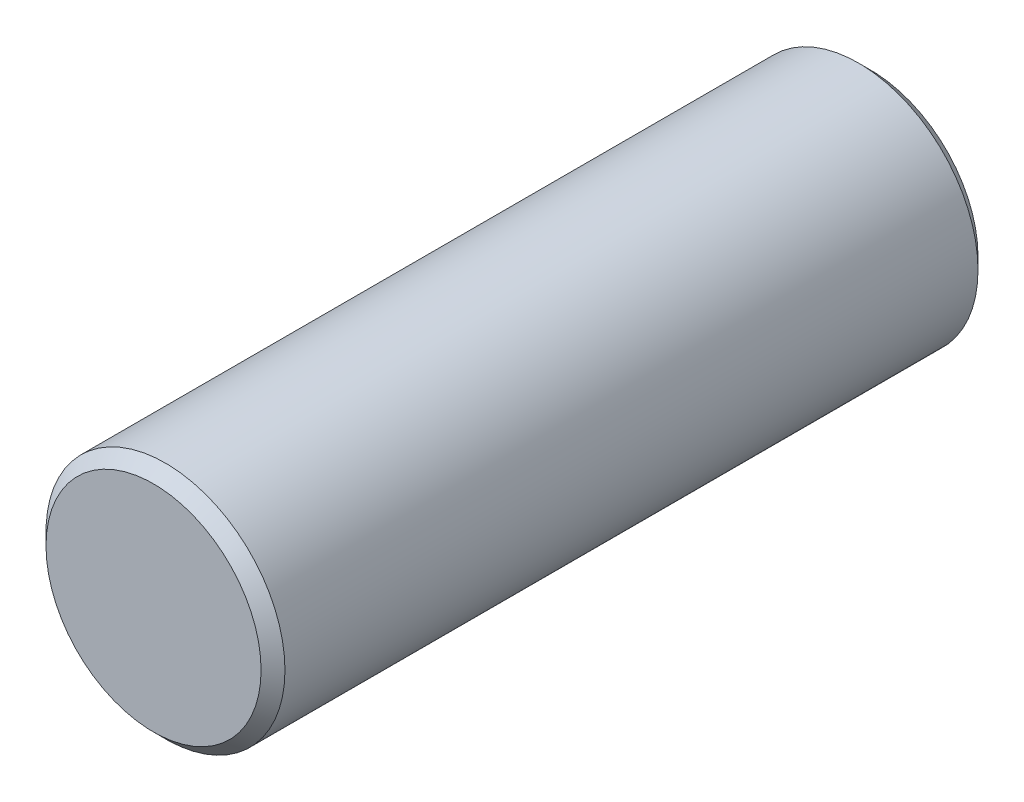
ISO-10303-21;
HEADER;
FILE_DESCRIPTION(('STEP AP214'),'2;1');
FILE_NAME('part.step','',(''),(''),'','','');
FILE_SCHEMA(('AUTOMOTIVE_DESIGN { 1 0 10303 214 1 1 1 1 }'));
ENDSEC;
DATA;
#1=APPLICATION_CONTEXT('core data for automotive mechanical design processes');
#2=APPLICATION_PROTOCOL_DEFINITION('international standard','automotive_design',2000,#1);
#3=PRODUCT_CONTEXT('',#1,'mechanical');
#4=PRODUCT('Part','Part','',(#3));
#5=PRODUCT_RELATED_PRODUCT_CATEGORY('part','',(#4));
#6=PRODUCT_DEFINITION_FORMATION('','',#4);
#7=PRODUCT_DEFINITION_CONTEXT('part definition',#1,'design');
#8=PRODUCT_DEFINITION('design','',#6,#7);
#9=PRODUCT_DEFINITION_SHAPE('','',#8);
#10=(LENGTH_UNIT() NAMED_UNIT(*) SI_UNIT(.MILLI.,.METRE.));
#11=(NAMED_UNIT(*) PLANE_ANGLE_UNIT() SI_UNIT($,.RADIAN.));
#12=(NAMED_UNIT(*) SI_UNIT($,.STERADIAN.) SOLID_ANGLE_UNIT());
#13=UNCERTAINTY_MEASURE_WITH_UNIT(LENGTH_MEASURE(1.E-05),#10,'distance_accuracy_value','');
#14=(GEOMETRIC_REPRESENTATION_CONTEXT(3) GLOBAL_UNCERTAINTY_ASSIGNED_CONTEXT((#13)) GLOBAL_UNIT_ASSIGNED_CONTEXT((#10,
#11,#12)) REPRESENTATION_CONTEXT('',''));
#15=CARTESIAN_POINT('',(0.,0.,0.));
#16=DIRECTION('',(0.,0.,1.));
#17=DIRECTION('',(1.,0.,0.));
#18=AXIS2_PLACEMENT_3D('',#15,#16,#17);
#19=CARTESIAN_POINT('',(0.,0.,30.));
#20=DIRECTION('',(0.,0.,-1.));
#21=DIRECTION('',(-1.,0.,0.));
#22=AXIS2_PLACEMENT_3D('',#19,#20,#21);
#23=CYLINDRICAL_SURFACE('',#22,5.);
#24=CARTESIAN_POINT('',(0.,0.,0.499999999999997));
#25=DIRECTION('',(0.,0.,1.));
#26=DIRECTION('',(1.,0.,0.));
#27=AXIS2_PLACEMENT_3D('',#24,#25,#26);
#28=CIRCLE('',#27,5.);
#29=CARTESIAN_POINT('',(5.,0.,0.499999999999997));
#30=VERTEX_POINT('',#29);
#31=EDGE_CURVE('E45',#30,#30,#28,.T.);
#32=ORIENTED_EDGE('',*,*,#31,.T.);
#33=EDGE_LOOP('',(#32));
#34=FACE_BOUND('',#33,.T.);
#35=CARTESIAN_POINT('',(0.,0.,29.5));
#36=DIRECTION('',(0.,0.,1.));
#37=DIRECTION('',(1.,0.,0.));
#38=AXIS2_PLACEMENT_3D('',#35,#36,#37);
#39=CIRCLE('',#38,5.);
#40=CARTESIAN_POINT('',(5.,0.,29.5));
#41=VERTEX_POINT('',#40);
#42=EDGE_CURVE('E49',#41,#41,#39,.F.);
#43=ORIENTED_EDGE('',*,*,#42,.T.);
#44=EDGE_LOOP('',(#43));
#45=FACE_BOUND('',#44,.T.);
#46=ADVANCED_FACE('F34',(#34,#45),#23,.T.);
#47=CARTESIAN_POINT('',(0.,0.,30.));
#48=DIRECTION('',(0.,0.,1.));
#49=DIRECTION('',(1.,0.,0.));
#50=AXIS2_PLACEMENT_3D('',#47,#48,#49);
#51=PLANE('',#50);
#52=CARTESIAN_POINT('',(0.,0.,30.));
#53=DIRECTION('',(0.,0.,1.));
#54=DIRECTION('',(1.,0.,0.));
#55=AXIS2_PLACEMENT_3D('',#52,#53,#54);
#56=CIRCLE('',#55,4.5);
#57=CARTESIAN_POINT('',(4.5,0.,30.));
#58=VERTEX_POINT('',#57);
#59=EDGE_CURVE('E10',#58,#58,#56,.T.);
#60=ORIENTED_EDGE('',*,*,#59,.T.);
#61=EDGE_LOOP('',(#60));
#62=FACE_BOUND('',#61,.T.);
#63=ADVANCED_FACE('F65',(#62),#51,.T.);
#64=CARTESIAN_POINT('',(0.,0.,0.));
#65=DIRECTION('',(0.,0.,1.));
#66=DIRECTION('',(1.,0.,0.));
#67=AXIS2_PLACEMENT_3D('',#64,#65,#66);
#68=PLANE('',#67);
#69=CARTESIAN_POINT('',(0.,0.,0.));
#70=DIRECTION('',(0.,0.,1.));
#71=DIRECTION('',(1.,0.,0.));
#72=AXIS2_PLACEMENT_3D('',#69,#70,#71);
#73=CIRCLE('',#72,4.5);
#74=CARTESIAN_POINT('',(4.5,0.,0.));
#75=VERTEX_POINT('',#74);
#76=EDGE_CURVE('E41',#75,#75,#73,.F.);
#77=ORIENTED_EDGE('',*,*,#76,.T.);
#78=EDGE_LOOP('',(#77));
#79=FACE_BOUND('',#78,.T.);
#80=ADVANCED_FACE('F62',(#79),#68,.F.);
#81=CARTESIAN_POINT('',(0.,0.,0.499999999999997));
#82=DIRECTION('',(0.,0.,1.));
#83=DIRECTION('',(1.,0.,0.));
#84=AXIS2_PLACEMENT_3D('',#81,#82,#83);
#85=CONICAL_SURFACE('',#84,5.,0.785398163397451);
#86=ORIENTED_EDGE('',*,*,#76,.F.);
#87=EDGE_LOOP('',(#86));
#88=FACE_BOUND('',#87,.T.);
#89=ORIENTED_EDGE('',*,*,#31,.F.);
#90=EDGE_LOOP('',(#89));
#91=FACE_BOUND('',#90,.T.);
#92=ADVANCED_FACE('F58',(#88,#91),#85,.T.);
#93=CARTESIAN_POINT('',(0.,0.,30.));
#94=DIRECTION('',(0.,0.,-1.));
#95=DIRECTION('',(-1.,0.,0.));
#96=AXIS2_PLACEMENT_3D('',#93,#94,#95);
#97=CONICAL_SURFACE('',#96,4.5,0.785398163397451);
#98=ORIENTED_EDGE('',*,*,#42,.F.);
#99=EDGE_LOOP('',(#98));
#100=FACE_BOUND('',#99,.T.);
#101=ORIENTED_EDGE('',*,*,#59,.F.);
#102=EDGE_LOOP('',(#101));
#103=FACE_BOUND('',#102,.T.);
#104=ADVANCED_FACE('F36',(#100,#103),#97,.T.);
#105=CLOSED_SHELL('',(#46,#63,#80,#92,#104));
#106=MANIFOLD_SOLID_BREP('B2',#105);
#107=ADVANCED_BREP_SHAPE_REPRESENTATION('',(#18,#106),#14);
#108=SHAPE_DEFINITION_REPRESENTATION(#9,#107);
ENDSEC;
END-ISO-10303-21;
